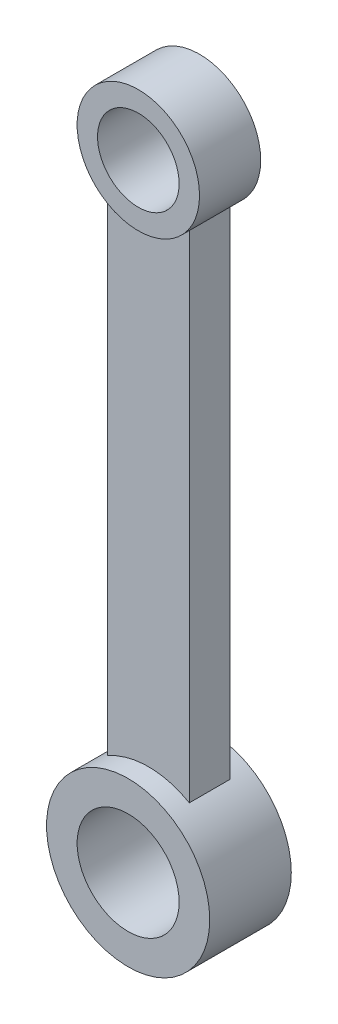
ISO-10303-21;
HEADER;
FILE_DESCRIPTION(('STEP AP214'),'2;1');
FILE_NAME('part.step','',(''),(''),'','','');
FILE_SCHEMA(('AUTOMOTIVE_DESIGN { 1 0 10303 214 1 1 1 1 }'));
ENDSEC;
DATA;
#1=APPLICATION_CONTEXT('core data for automotive mechanical design processes');
#2=APPLICATION_PROTOCOL_DEFINITION('international standard','automotive_design',2000,#1);
#3=PRODUCT_CONTEXT('',#1,'mechanical');
#4=PRODUCT('Part','Part','',(#3));
#5=PRODUCT_RELATED_PRODUCT_CATEGORY('part','',(#4));
#6=PRODUCT_DEFINITION_FORMATION('','',#4);
#7=PRODUCT_DEFINITION_CONTEXT('part definition',#1,'design');
#8=PRODUCT_DEFINITION('design','',#6,#7);
#9=PRODUCT_DEFINITION_SHAPE('','',#8);
#10=(LENGTH_UNIT() NAMED_UNIT(*) SI_UNIT(.MILLI.,.METRE.));
#11=(NAMED_UNIT(*) PLANE_ANGLE_UNIT() SI_UNIT($,.RADIAN.));
#12=(NAMED_UNIT(*) SI_UNIT($,.STERADIAN.) SOLID_ANGLE_UNIT());
#13=UNCERTAINTY_MEASURE_WITH_UNIT(LENGTH_MEASURE(1.E-05),#10,'distance_accuracy_value','');
#14=(GEOMETRIC_REPRESENTATION_CONTEXT(3) GLOBAL_UNCERTAINTY_ASSIGNED_CONTEXT((#13)) GLOBAL_UNIT_ASSIGNED_CONTEXT((#10,
#11,#12)) REPRESENTATION_CONTEXT('',''));
#15=CARTESIAN_POINT('',(0.,0.,0.));
#16=DIRECTION('',(0.,0.,1.));
#17=DIRECTION('',(1.,0.,0.));
#18=AXIS2_PLACEMENT_3D('',#15,#16,#17);
#19=CARTESIAN_POINT('',(10.,0.,5.));
#20=DIRECTION('',(1.,0.,0.));
#21=DIRECTION('',(0.,0.,-1.));
#22=AXIS2_PLACEMENT_3D('',#19,#20,#21);
#23=PLANE('',#22);
#24=DIRECTION('',(0.,-1.,0.));
#25=VECTOR('',#24,1.);
#26=CARTESIAN_POINT('',(10.,0.,-5.));
#27=LINE('',#26,#25);
#28=CARTESIAN_POINT('',(10.,138.819660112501,-5.));
#29=VERTEX_POINT('',#28);
#30=CARTESIAN_POINT('',(10.,17.3205080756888,-5.));
#31=VERTEX_POINT('',#30);
#32=EDGE_CURVE('E88',#29,#31,#27,.T.);
#33=ORIENTED_EDGE('',*,*,#32,.F.);
#34=DIRECTION('',(0.,0.,-1.));
#35=VECTOR('',#34,1.);
#36=CARTESIAN_POINT('',(10.,138.819660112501,5.));
#37=LINE('',#36,#35);
#38=CARTESIAN_POINT('',(10.,138.819660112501,5.));
#39=VERTEX_POINT('',#38);
#40=EDGE_CURVE('E50',#39,#29,#37,.T.);
#41=ORIENTED_EDGE('',*,*,#40,.F.);
#42=DIRECTION('',(0.,-1.,0.));
#43=VECTOR('',#42,1.);
#44=CARTESIAN_POINT('',(10.,0.,5.));
#45=LINE('',#44,#43);
#46=CARTESIAN_POINT('',(10.,17.3205080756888,5.));
#47=VERTEX_POINT('',#46);
#48=EDGE_CURVE('E95',#39,#47,#45,.T.);
#49=ORIENTED_EDGE('',*,*,#48,.T.);
#50=DIRECTION('',(0.,0.,-1.));
#51=VECTOR('',#50,1.);
#52=CARTESIAN_POINT('',(10.,17.3205080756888,5.));
#53=LINE('',#52,#51);
#54=EDGE_CURVE('E11',#47,#31,#53,.T.);
#55=ORIENTED_EDGE('',*,*,#54,.T.);
#56=EDGE_LOOP('',(#33,#41,#49,#55));
#57=FACE_BOUND('',#56,.T.);
#58=ADVANCED_FACE('F42',(#57),#23,.T.);
#59=CARTESIAN_POINT('',(-10.,0.,5.));
#60=DIRECTION('',(1.,0.,0.));
#61=DIRECTION('',(0.,0.,-1.));
#62=AXIS2_PLACEMENT_3D('',#59,#60,#61);
#63=PLANE('',#62);
#64=DIRECTION('',(0.,-1.,0.));
#65=VECTOR('',#64,1.);
#66=CARTESIAN_POINT('',(-10.,0.,-5.));
#67=LINE('',#66,#65);
#68=CARTESIAN_POINT('',(-10.,138.819660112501,-5.));
#69=VERTEX_POINT('',#68);
#70=CARTESIAN_POINT('',(-10.,17.3205080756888,-5.));
#71=VERTEX_POINT('',#70);
#72=EDGE_CURVE('E102',#69,#71,#67,.T.);
#73=ORIENTED_EDGE('',*,*,#72,.T.);
#74=DIRECTION('',(0.,0.,-1.));
#75=VECTOR('',#74,1.);
#76=CARTESIAN_POINT('',(-10.,17.3205080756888,5.));
#77=LINE('',#76,#75);
#78=CARTESIAN_POINT('',(-10.,17.3205080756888,5.));
#79=VERTEX_POINT('',#78);
#80=EDGE_CURVE('E57',#79,#71,#77,.T.);
#81=ORIENTED_EDGE('',*,*,#80,.F.);
#82=DIRECTION('',(0.,-1.,0.));
#83=VECTOR('',#82,1.);
#84=CARTESIAN_POINT('',(-10.,0.,5.));
#85=LINE('',#84,#83);
#86=CARTESIAN_POINT('',(-10.,138.819660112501,5.));
#87=VERTEX_POINT('',#86);
#88=EDGE_CURVE('E112',#87,#79,#85,.T.);
#89=ORIENTED_EDGE('',*,*,#88,.F.);
#90=DIRECTION('',(0.,0.,-1.));
#91=VECTOR('',#90,1.);
#92=CARTESIAN_POINT('',(-10.,138.819660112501,5.));
#93=LINE('',#92,#91);
#94=EDGE_CURVE('E111',#87,#69,#93,.T.);
#95=ORIENTED_EDGE('',*,*,#94,.T.);
#96=EDGE_LOOP('',(#73,#81,#89,#95));
#97=FACE_BOUND('',#96,.T.);
#98=ADVANCED_FACE('F192',(#97),#63,.F.);
#99=CARTESIAN_POINT('',(0.,0.,5.));
#100=DIRECTION('',(0.,0.,1.));
#101=DIRECTION('',(1.,0.,0.));
#102=AXIS2_PLACEMENT_3D('',#99,#100,#101);
#103=PLANE('',#102);
#104=CARTESIAN_POINT('',(0.,0.,5.));
#105=DIRECTION('',(0.,0.,1.));
#106=DIRECTION('',(1.,0.,0.));
#107=AXIS2_PLACEMENT_3D('',#104,#105,#106);
#108=CIRCLE('',#107,20.);
#109=EDGE_CURVE('E108',#47,#79,#108,.T.);
#110=ORIENTED_EDGE('',*,*,#109,.F.);
#111=ORIENTED_EDGE('',*,*,#48,.F.);
#112=CARTESIAN_POINT('',(0.,150.,5.));
#113=DIRECTION('',(0.,0.,1.));
#114=DIRECTION('',(1.,0.,0.));
#115=AXIS2_PLACEMENT_3D('',#112,#113,#114);
#116=CIRCLE('',#115,15.);
#117=EDGE_CURVE('E122',#87,#39,#116,.T.);
#118=ORIENTED_EDGE('',*,*,#117,.F.);
#119=ORIENTED_EDGE('',*,*,#88,.T.);
#120=EDGE_LOOP('',(#110,#111,#118,#119));
#121=FACE_BOUND('',#120,.T.);
#122=ADVANCED_FACE('F196',(#121),#103,.T.);
#123=CARTESIAN_POINT('',(0.,0.,-5.));
#124=DIRECTION('',(0.,0.,1.));
#125=DIRECTION('',(1.,0.,0.));
#126=AXIS2_PLACEMENT_3D('',#123,#124,#125);
#127=PLANE('',#126);
#128=CARTESIAN_POINT('',(0.,0.,-5.));
#129=DIRECTION('',(0.,0.,1.));
#130=DIRECTION('',(1.,0.,0.));
#131=AXIS2_PLACEMENT_3D('',#128,#129,#130);
#132=CIRCLE('',#131,20.);
#133=EDGE_CURVE('E80',#31,#71,#132,.T.);
#134=ORIENTED_EDGE('',*,*,#133,.T.);
#135=ORIENTED_EDGE('',*,*,#72,.F.);
#136=CARTESIAN_POINT('',(0.,150.,-5.));
#137=DIRECTION('',(0.,0.,1.));
#138=DIRECTION('',(1.,0.,0.));
#139=AXIS2_PLACEMENT_3D('',#136,#137,#138);
#140=CIRCLE('',#139,15.);
#141=EDGE_CURVE('E97',#69,#29,#140,.T.);
#142=ORIENTED_EDGE('',*,*,#141,.T.);
#143=ORIENTED_EDGE('',*,*,#32,.T.);
#144=EDGE_LOOP('',(#134,#135,#142,#143));
#145=FACE_BOUND('',#144,.T.);
#146=ADVANCED_FACE('F96',(#145),#127,.F.);
#147=CARTESIAN_POINT('',(0.,150.,7.5));
#148=DIRECTION('',(0.,0.,-1.));
#149=DIRECTION('',(-1.,0.,0.));
#150=AXIS2_PLACEMENT_3D('',#147,#148,#149);
#151=CYLINDRICAL_SURFACE('',#150,15.);
#152=ORIENTED_EDGE('',*,*,#117,.T.);
#153=ORIENTED_EDGE('',*,*,#40,.T.);
#154=ORIENTED_EDGE('',*,*,#141,.F.);
#155=ORIENTED_EDGE('',*,*,#94,.F.);
#156=EDGE_LOOP('',(#152,#153,#154,#155));
#157=FACE_BOUND('',#156,.T.);
#158=CARTESIAN_POINT('',(0.,150.,7.5));
#159=DIRECTION('',(0.,0.,1.));
#160=DIRECTION('',(1.,0.,0.));
#161=AXIS2_PLACEMENT_3D('',#158,#159,#160);
#162=CIRCLE('',#161,15.);
#163=CARTESIAN_POINT('',(15.,150.,7.5));
#164=VERTEX_POINT('',#163);
#165=EDGE_CURVE('E136',#164,#164,#162,.T.);
#166=ORIENTED_EDGE('',*,*,#165,.F.);
#167=EDGE_LOOP('',(#166));
#168=FACE_BOUND('',#167,.T.);
#169=CARTESIAN_POINT('',(0.,150.,-7.5));
#170=DIRECTION('',(0.,0.,1.));
#171=DIRECTION('',(1.,0.,0.));
#172=AXIS2_PLACEMENT_3D('',#169,#170,#171);
#173=CIRCLE('',#172,15.);
#174=CARTESIAN_POINT('',(15.,150.,-7.5));
#175=VERTEX_POINT('',#174);
#176=EDGE_CURVE('E137',#175,#175,#173,.T.);
#177=ORIENTED_EDGE('',*,*,#176,.T.);
#178=EDGE_LOOP('',(#177));
#179=FACE_BOUND('',#178,.T.);
#180=ADVANCED_FACE('F205',(#157,#168,#179),#151,.T.);
#181=CARTESIAN_POINT('',(0.,150.,7.5));
#182=DIRECTION('',(0.,0.,-1.));
#183=DIRECTION('',(-1.,0.,0.));
#184=AXIS2_PLACEMENT_3D('',#181,#182,#183);
#185=CYLINDRICAL_SURFACE('',#184,10.);
#186=CARTESIAN_POINT('',(0.,150.,7.5));
#187=DIRECTION('',(0.,0.,1.));
#188=DIRECTION('',(1.,0.,0.));
#189=AXIS2_PLACEMENT_3D('',#186,#187,#188);
#190=CIRCLE('',#189,10.);
#191=CARTESIAN_POINT('',(10.,150.,7.5));
#192=VERTEX_POINT('',#191);
#193=EDGE_CURVE('E89',#192,#192,#190,.T.);
#194=ORIENTED_EDGE('',*,*,#193,.T.);
#195=EDGE_LOOP('',(#194));
#196=FACE_BOUND('',#195,.T.);
#197=CARTESIAN_POINT('',(0.,150.,-7.5));
#198=DIRECTION('',(0.,0.,1.));
#199=DIRECTION('',(1.,0.,0.));
#200=AXIS2_PLACEMENT_3D('',#197,#198,#199);
#201=CIRCLE('',#200,10.);
#202=CARTESIAN_POINT('',(10.,150.,-7.5));
#203=VERTEX_POINT('',#202);
#204=EDGE_CURVE('E132',#203,#203,#201,.T.);
#205=ORIENTED_EDGE('',*,*,#204,.F.);
#206=EDGE_LOOP('',(#205));
#207=FACE_BOUND('',#206,.T.);
#208=ADVANCED_FACE('F209',(#196,#207),#185,.F.);
#209=CARTESIAN_POINT('',(0.,0.,7.5));
#210=DIRECTION('',(0.,0.,1.));
#211=DIRECTION('',(1.,0.,0.));
#212=AXIS2_PLACEMENT_3D('',#209,#210,#211);
#213=PLANE('',#212);
#214=ORIENTED_EDGE('',*,*,#165,.T.);
#215=EDGE_LOOP('',(#214));
#216=FACE_BOUND('',#215,.T.);
#217=ORIENTED_EDGE('',*,*,#193,.F.);
#218=EDGE_LOOP('',(#217));
#219=FACE_BOUND('',#218,.T.);
#220=ADVANCED_FACE('F212',(#216,#219),#213,.T.);
#221=CARTESIAN_POINT('',(0.,0.,-7.5));
#222=DIRECTION('',(0.,0.,1.));
#223=DIRECTION('',(1.,0.,0.));
#224=AXIS2_PLACEMENT_3D('',#221,#222,#223);
#225=PLANE('',#224);
#226=ORIENTED_EDGE('',*,*,#176,.F.);
#227=EDGE_LOOP('',(#226));
#228=FACE_BOUND('',#227,.T.);
#229=ORIENTED_EDGE('',*,*,#204,.T.);
#230=EDGE_LOOP('',(#229));
#231=FACE_BOUND('',#230,.T.);
#232=ADVANCED_FACE('F214',(#228,#231),#225,.F.);
#233=CARTESIAN_POINT('',(0.,0.,10.));
#234=DIRECTION('',(0.,0.,-1.));
#235=DIRECTION('',(-1.,0.,0.));
#236=AXIS2_PLACEMENT_3D('',#233,#234,#235);
#237=CYLINDRICAL_SURFACE('',#236,12.5);
#238=CARTESIAN_POINT('',(0.,0.,10.));
#239=DIRECTION('',(0.,0.,1.));
#240=DIRECTION('',(1.,0.,0.));
#241=AXIS2_PLACEMENT_3D('',#238,#239,#240);
#242=CIRCLE('',#241,12.5);
#243=CARTESIAN_POINT('',(12.5,0.,10.));
#244=VERTEX_POINT('',#243);
#245=EDGE_CURVE('E156',#244,#244,#242,.T.);
#246=ORIENTED_EDGE('',*,*,#245,.T.);
#247=EDGE_LOOP('',(#246));
#248=FACE_BOUND('',#247,.T.);
#249=CARTESIAN_POINT('',(0.,0.,-10.));
#250=DIRECTION('',(0.,0.,1.));
#251=DIRECTION('',(1.,0.,0.));
#252=AXIS2_PLACEMENT_3D('',#249,#250,#251);
#253=CIRCLE('',#252,12.5);
#254=CARTESIAN_POINT('',(12.5,0.,-10.));
#255=VERTEX_POINT('',#254);
#256=EDGE_CURVE('E157',#255,#255,#253,.T.);
#257=ORIENTED_EDGE('',*,*,#256,.F.);
#258=EDGE_LOOP('',(#257));
#259=FACE_BOUND('',#258,.T.);
#260=ADVANCED_FACE('F172',(#248,#259),#237,.F.);
#261=CARTESIAN_POINT('',(0.,0.,10.));
#262=DIRECTION('',(0.,0.,-1.));
#263=DIRECTION('',(-1.,0.,0.));
#264=AXIS2_PLACEMENT_3D('',#261,#262,#263);
#265=CYLINDRICAL_SURFACE('',#264,20.);
#266=ORIENTED_EDGE('',*,*,#109,.T.);
#267=ORIENTED_EDGE('',*,*,#80,.T.);
#268=ORIENTED_EDGE('',*,*,#133,.F.);
#269=ORIENTED_EDGE('',*,*,#54,.F.);
#270=EDGE_LOOP('',(#266,#267,#268,#269));
#271=FACE_BOUND('',#270,.T.);
#272=CARTESIAN_POINT('',(0.,0.,10.));
#273=DIRECTION('',(0.,0.,1.));
#274=DIRECTION('',(1.,0.,0.));
#275=AXIS2_PLACEMENT_3D('',#272,#273,#274);
#276=CIRCLE('',#275,20.);
#277=CARTESIAN_POINT('',(20.,0.,10.));
#278=VERTEX_POINT('',#277);
#279=EDGE_CURVE('E142',#278,#278,#276,.T.);
#280=ORIENTED_EDGE('',*,*,#279,.F.);
#281=EDGE_LOOP('',(#280));
#282=FACE_BOUND('',#281,.T.);
#283=CARTESIAN_POINT('',(0.,0.,-10.));
#284=DIRECTION('',(0.,0.,1.));
#285=DIRECTION('',(1.,0.,0.));
#286=AXIS2_PLACEMENT_3D('',#283,#284,#285);
#287=CIRCLE('',#286,20.);
#288=CARTESIAN_POINT('',(20.,0.,-10.));
#289=VERTEX_POINT('',#288);
#290=EDGE_CURVE('E152',#289,#289,#287,.T.);
#291=ORIENTED_EDGE('',*,*,#290,.T.);
#292=EDGE_LOOP('',(#291));
#293=FACE_BOUND('',#292,.T.);
#294=ADVANCED_FACE('F81',(#271,#282,#293),#265,.T.);
#295=CARTESIAN_POINT('',(0.,0.,10.));
#296=DIRECTION('',(0.,0.,1.));
#297=DIRECTION('',(1.,0.,0.));
#298=AXIS2_PLACEMENT_3D('',#295,#296,#297);
#299=PLANE('',#298);
#300=ORIENTED_EDGE('',*,*,#245,.F.);
#301=EDGE_LOOP('',(#300));
#302=FACE_BOUND('',#301,.T.);
#303=ORIENTED_EDGE('',*,*,#279,.T.);
#304=EDGE_LOOP('',(#303));
#305=FACE_BOUND('',#304,.T.);
#306=ADVANCED_FACE('F175',(#302,#305),#299,.T.);
#307=CARTESIAN_POINT('',(0.,0.,-10.));
#308=DIRECTION('',(0.,0.,1.));
#309=DIRECTION('',(1.,0.,0.));
#310=AXIS2_PLACEMENT_3D('',#307,#308,#309);
#311=PLANE('',#310);
#312=ORIENTED_EDGE('',*,*,#256,.T.);
#313=EDGE_LOOP('',(#312));
#314=FACE_BOUND('',#313,.T.);
#315=ORIENTED_EDGE('',*,*,#290,.F.);
#316=EDGE_LOOP('',(#315));
#317=FACE_BOUND('',#316,.T.);
#318=ADVANCED_FACE('F178',(#314,#317),#311,.F.);
#319=CLOSED_SHELL('',(#58,#98,#122,#146,#180,#208,#220,#232,#260,#294,#306,#318));
#320=MANIFOLD_SOLID_BREP('B2',#319);
#321=ADVANCED_BREP_SHAPE_REPRESENTATION('',(#18,#320),#14);
#322=SHAPE_DEFINITION_REPRESENTATION(#9,#321);
ENDSEC;
END-ISO-10303-21;
